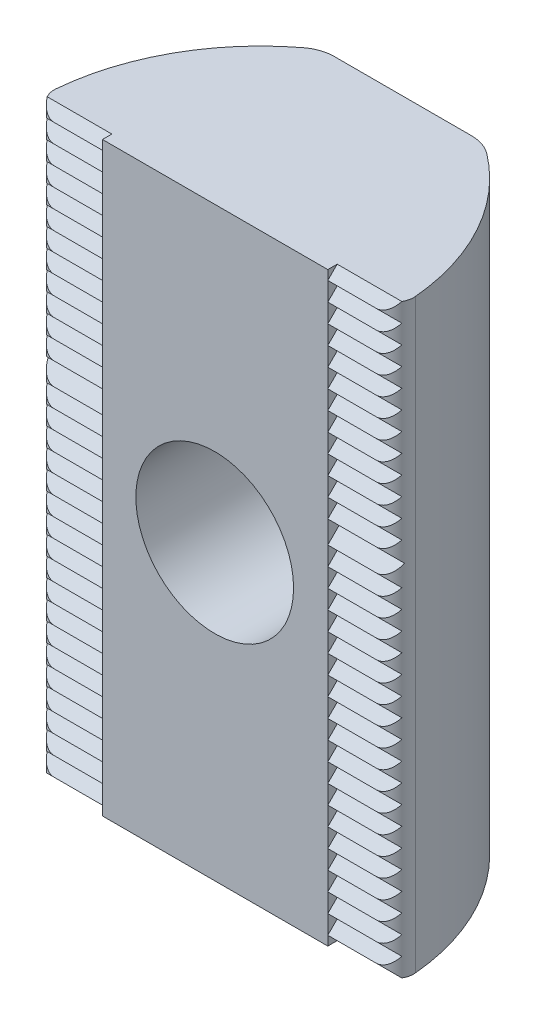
from build123d import *

# Parameters (mm, degrees)
EXTRUDE_1_DEPTH     = 7.8
M5X0_8_1_D          = 4.2
CUT_EXTRUDE_2_DEPTH = 13.103698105
CUT_EXTRUDE_3_DEPTH = 13.103698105


with BuildPart() as part:
    # Sketch 1 → Extrude 1 (new, symmetric)
    with BuildSketch(Plane.XZ):
        with BuildLine():
            Line((-4.28842123, 0), (4.28842123, 0))
            ThreePointArc((4.28842123, 0), (4.657211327, -0.162370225), (4.786479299, -0.54402454))
            ThreePointArc((4.786479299, -0.54402454), (4.060490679, -2.919187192), (2.434814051, -4.796853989))
            ThreePointArc((2.434814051, -4.796853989), (2.149347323, -4.947853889), (1.830642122, -5))
            Line((1.830642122, -5), (-1.830642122, -5))
            ThreePointArc((-1.830642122, -5), (-2.149347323, -4.947853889), (-2.434814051, -4.796853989))
            ThreePointArc((-2.434814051, -4.796853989), (-4.060490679, -2.919187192), (-4.786479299, -0.54402454))
            ThreePointArc((-4.786479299, -0.54402454), (-4.657211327, -0.162370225), (-4.28842123, 0))
        make_face()
    extrude(amount=EXTRUDE_1_DEPTH, both=True)

    # M5x0.8 _1 (through all)
    with Locations(Plane(origin=(1.337388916, 5.214464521, 0), x_dir=(1, 0, 0), z_dir=(0, 0, 1))):
        with Locations((-1.348967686, -5.214464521)):
            Hole(M5X0_8_1_D / 2)

    # Sketch 4 → Cut-Extrude 2 (cut, through all)
    with BuildSketch(Plane(origin=(3, 0, 0), x_dir=(0, 0, -1), z_dir=(1, 0, 0))):
        Polygon((0.25, -7.8), (-2.012448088, -7.8), (-2.012448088, 7.8), (0.25, 7.8), (0, 7.55), (0.25, 7.3), (0, 7.05), (0.25, 6.8), (0, 6.55), (0.25, 6.3), (0, 6.05), (0.25, 5.8), (0, 5.55), (0.25, 5.3), (0, 5.05), (0.25, 4.8), (0, 4.55), (0.25, 4.3), (0, 4.05), (0.25, 3.8), (0, 3.55), (0.25, 3.3), (0, 3.05), (0.25, 2.8), (0, 2.55), (0.25, 2.3), (0, 2.05), (0.3, 1.75), (0, 1.45), (0.25, 1.2), (0, 0.95), (0.25, 0.7), (0, 0.45), (0.25, 0.2), (0, -0.05), (0.25, -0.3), (0, -0.55), (0.25, -0.8), (0, -1.05), (0.25, -1.3), (0, -1.55), (0.25, -1.8), (0, -2.05), (0.25, -2.3), (0, -2.55), (0.25, -2.8), (0, -3.05), (0.25, -3.3), (0, -3.55), (0.25, -3.8), (0, -4.05), (0.25, -4.3), (0, -4.55), (0.25, -4.8), (0, -5.05), (0.25, -5.3), (0, -5.55), (0.25, -5.8), (0, -6.05), (0.25, -6.3), (0, -6.55), (0.25, -6.8), (0, -7.05), (0.25, -7.3), (0, -7.55), align=None)
    extrude(amount=CUT_EXTRUDE_2_DEPTH, mode=Mode.SUBTRACT)

    # Sketch 5 → Cut-Extrude 3 (cut, through all)
    with BuildSketch(Plane(origin=(-3, 0, 0), x_dir=(0, 0, -1), z_dir=(1, 0, 0))):
        Polygon((-2.012448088, 7.8), (0.25, 7.8), (0, 7.55), (0.25, 7.3), (0, 7.05), (0.25, 6.8), (0, 6.55), (0.25, 6.3), (0, 6.05), (0.25, 5.8), (0, 5.55), (0.25, 5.3), (0, 5.05), (0.25, 4.8), (0, 4.55), (0.25, 4.3), (0, 4.05), (0.25, 3.8), (0, 3.55), (0.25, 3.3), (0, 3.05), (0.25, 2.8), (0, 2.55), (0.25, 2.3), (0, 2.05), (0.3, 1.75), (0, 1.45), (0.25, 1.2), (0, 0.95), (0.25, 0.7), (0, 0.45), (0.25, 0.2), (0, -0.05), (0.25, -0.3), (0, -0.55), (0.25, -0.8), (0, -1.05), (0.25, -1.3), (0, -1.55), (0.25, -1.8), (0, -2.05), (0.25, -2.3), (0, -2.55), (0.25, -2.8), (0, -3.05), (0.25, -3.3), (0, -3.55), (0.25, -3.8), (0, -4.05), (0.25, -4.3), (0, -4.55), (0.25, -4.8), (0, -5.05), (0.25, -5.3), (0, -5.55), (0.25, -5.8), (0, -6.05), (0.25, -6.3), (0, -6.55), (0.25, -6.8), (0, -7.05), (0.25, -7.3), (0, -7.55), (0.25, -7.8), (-2.012448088, -7.8), align=None)
    extrude(amount=-CUT_EXTRUDE_3_DEPTH, mode=Mode.SUBTRACT)


solid = part.part
